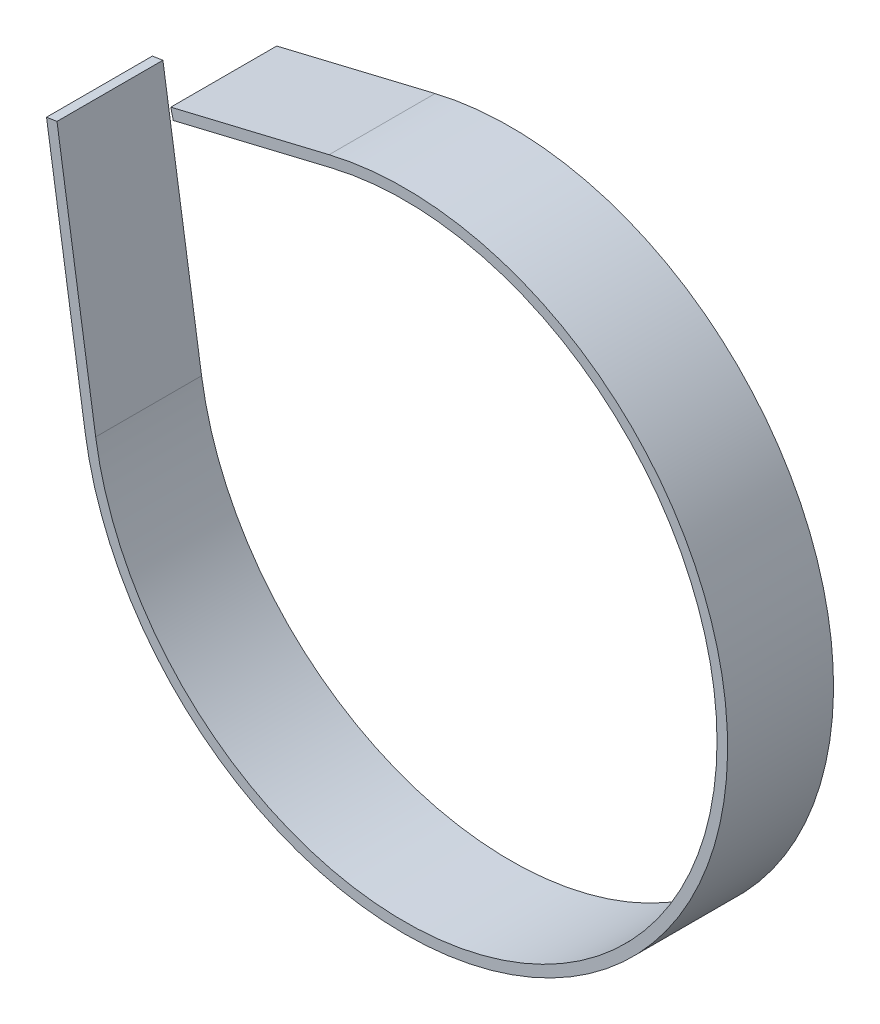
ISO-10303-21;
HEADER;
FILE_DESCRIPTION(('STEP AP214'),'2;1');
FILE_NAME('part.step','',(''),(''),'','','');
FILE_SCHEMA(('AUTOMOTIVE_DESIGN { 1 0 10303 214 1 1 1 1 }'));
ENDSEC;
DATA;
#1=APPLICATION_CONTEXT('core data for automotive mechanical design processes');
#2=APPLICATION_PROTOCOL_DEFINITION('international standard','automotive_design',2000,#1);
#3=PRODUCT_CONTEXT('',#1,'mechanical');
#4=PRODUCT('Part','Part','',(#3));
#5=PRODUCT_RELATED_PRODUCT_CATEGORY('part','',(#4));
#6=PRODUCT_DEFINITION_FORMATION('','',#4);
#7=PRODUCT_DEFINITION_CONTEXT('part definition',#1,'design');
#8=PRODUCT_DEFINITION('design','',#6,#7);
#9=PRODUCT_DEFINITION_SHAPE('','',#8);
#10=(LENGTH_UNIT() NAMED_UNIT(*) SI_UNIT(.MILLI.,.METRE.));
#11=(NAMED_UNIT(*) PLANE_ANGLE_UNIT() SI_UNIT($,.RADIAN.));
#12=(NAMED_UNIT(*) SI_UNIT($,.STERADIAN.) SOLID_ANGLE_UNIT());
#13=UNCERTAINTY_MEASURE_WITH_UNIT(LENGTH_MEASURE(1.E-05),#10,'distance_accuracy_value','');
#14=(GEOMETRIC_REPRESENTATION_CONTEXT(3) GLOBAL_UNCERTAINTY_ASSIGNED_CONTEXT((#13)) GLOBAL_UNIT_ASSIGNED_CONTEXT((#10,
#11,#12)) REPRESENTATION_CONTEXT('',''));
#15=CARTESIAN_POINT('',(0.,0.,0.));
#16=DIRECTION('',(0.,0.,1.));
#17=DIRECTION('',(1.,0.,0.));
#18=AXIS2_PLACEMENT_3D('',#15,#16,#17);
#19=CARTESIAN_POINT('',(0.,0.,80.));
#20=DIRECTION('',(0.,0.,-1.));
#21=DIRECTION('',(-1.,0.,0.));
#22=AXIS2_PLACEMENT_3D('',#19,#20,#21);
#23=CYLINDRICAL_SURFACE('',#22,236.);
#24=CARTESIAN_POINT('',(0.,0.,0.));
#25=DIRECTION('',(0.,0.,-1.));
#26=DIRECTION('',(1.,0.,0.));
#27=AXIS2_PLACEMENT_3D('',#24,#25,#26);
#28=CIRCLE('',#27,236.);
#29=CARTESIAN_POINT('',(-55.0931058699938,229.479301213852,0.));
#30=VERTEX_POINT('',#29);
#31=CARTESIAN_POINT('',(-233.309422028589,-35.5346815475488,0.));
#32=VERTEX_POINT('',#31);
#33=EDGE_CURVE('E98',#30,#32,#28,.T.);
#34=ORIENTED_EDGE('',*,*,#33,.T.);
#35=DIRECTION('',(0.,0.,-1.));
#36=VECTOR('',#35,1.);
#37=CARTESIAN_POINT('',(-233.309422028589,-35.5346815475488,80.));
#38=LINE('',#37,#36);
#39=CARTESIAN_POINT('',(-233.309422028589,-35.5346815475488,80.));
#40=VERTEX_POINT('',#39);
#41=EDGE_CURVE('E11',#40,#32,#38,.T.);
#42=ORIENTED_EDGE('',*,*,#41,.F.);
#43=CARTESIAN_POINT('',(0.,0.,80.));
#44=DIRECTION('',(0.,0.,-1.));
#45=DIRECTION('',(1.,0.,0.));
#46=AXIS2_PLACEMENT_3D('',#43,#44,#45);
#47=CIRCLE('',#46,236.);
#48=CARTESIAN_POINT('',(-55.0931058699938,229.479301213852,80.));
#49=VERTEX_POINT('',#48);
#50=EDGE_CURVE('E125',#49,#40,#47,.T.);
#51=ORIENTED_EDGE('',*,*,#50,.F.);
#52=DIRECTION('',(0.,0.,-1.));
#53=VECTOR('',#52,1.);
#54=CARTESIAN_POINT('',(-55.0931058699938,229.479301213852,80.));
#55=LINE('',#54,#53);
#56=EDGE_CURVE('E111',#49,#30,#55,.T.);
#57=ORIENTED_EDGE('',*,*,#56,.T.);
#58=EDGE_LOOP('',(#34,#42,#51,#57));
#59=FACE_BOUND('',#58,.T.);
#60=ADVANCED_FACE('F30',(#59),#23,.F.);
#61=CARTESIAN_POINT('',(-233.309422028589,-35.5346815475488,80.));
#62=DIRECTION('',(-0.988599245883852,-0.150570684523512,0.));
#63=DIRECTION('',(0.150570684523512,-0.988599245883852,0.));
#64=AXIS2_PLACEMENT_3D('',#61,#62,#63);
#65=PLANE('',#64);
#66=DIRECTION('',(-0.150570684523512,0.988599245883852,0.));
#67=VECTOR('',#66,1.);
#68=CARTESIAN_POINT('',(-233.309422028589,-35.5346815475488,0.));
#69=LINE('',#68,#67);
#70=CARTESIAN_POINT('',(-262.52013482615,156.253572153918,0.));
#71=VERTEX_POINT('',#70);
#72=EDGE_CURVE('E94',#32,#71,#69,.T.);
#73=ORIENTED_EDGE('',*,*,#72,.T.);
#74=DIRECTION('',(0.,0.,-1.));
#75=VECTOR('',#74,1.);
#76=CARTESIAN_POINT('',(-262.52013482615,156.253572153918,80.));
#77=LINE('',#76,#75);
#78=CARTESIAN_POINT('',(-262.52013482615,156.253572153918,80.));
#79=VERTEX_POINT('',#78);
#80=EDGE_CURVE('E37',#79,#71,#77,.T.);
#81=ORIENTED_EDGE('',*,*,#80,.F.);
#82=DIRECTION('',(-0.150570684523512,0.988599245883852,0.));
#83=VECTOR('',#82,1.);
#84=CARTESIAN_POINT('',(-233.309422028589,-35.5346815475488,80.));
#85=LINE('',#84,#83);
#86=EDGE_CURVE('E107',#40,#79,#85,.T.);
#87=ORIENTED_EDGE('',*,*,#86,.F.);
#88=ORIENTED_EDGE('',*,*,#41,.T.);
#89=EDGE_LOOP('',(#73,#81,#87,#88));
#90=FACE_BOUND('',#89,.T.);
#91=ADVANCED_FACE('F106',(#90),#65,.F.);
#92=CARTESIAN_POINT('',(-270.428928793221,155.04900667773,80.));
#93=DIRECTION('',(0.150570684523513,-0.988599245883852,0.));
#94=DIRECTION('',(0.988599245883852,0.150570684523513,0.));
#95=AXIS2_PLACEMENT_3D('',#92,#93,#94);
#96=PLANE('',#95);
#97=DIRECTION('',(-0.988599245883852,-0.150570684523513,0.));
#98=VECTOR('',#97,1.);
#99=CARTESIAN_POINT('',(-270.428928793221,155.04900667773,0.));
#100=LINE('',#99,#98);
#101=CARTESIAN_POINT('',(-270.428928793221,155.04900667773,0.));
#102=VERTEX_POINT('',#101);
#103=EDGE_CURVE('E100',#71,#102,#100,.T.);
#104=ORIENTED_EDGE('',*,*,#103,.T.);
#105=DIRECTION('',(0.,0.,-1.));
#106=VECTOR('',#105,1.);
#107=CARTESIAN_POINT('',(-270.428928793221,155.04900667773,80.));
#108=LINE('',#107,#106);
#109=CARTESIAN_POINT('',(-270.428928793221,155.04900667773,80.));
#110=VERTEX_POINT('',#109);
#111=EDGE_CURVE('E151',#110,#102,#108,.T.);
#112=ORIENTED_EDGE('',*,*,#111,.F.);
#113=DIRECTION('',(-0.988599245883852,-0.150570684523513,0.));
#114=VECTOR('',#113,1.);
#115=CARTESIAN_POINT('',(-270.428928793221,155.04900667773,80.));
#116=LINE('',#115,#114);
#117=EDGE_CURVE('E128',#79,#110,#116,.T.);
#118=ORIENTED_EDGE('',*,*,#117,.F.);
#119=ORIENTED_EDGE('',*,*,#80,.T.);
#120=EDGE_LOOP('',(#104,#112,#118,#119));
#121=FACE_BOUND('',#120,.T.);
#122=ADVANCED_FACE('F155',(#121),#96,.F.);
#123=CARTESIAN_POINT('',(-241.21821599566,-36.739247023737,80.));
#124=DIRECTION('',(0.988599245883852,0.150570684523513,0.));
#125=DIRECTION('',(-0.150570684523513,0.988599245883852,0.));
#126=AXIS2_PLACEMENT_3D('',#123,#124,#125);
#127=PLANE('',#126);
#128=DIRECTION('',(0.150570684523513,-0.988599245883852,0.));
#129=VECTOR('',#128,1.);
#130=CARTESIAN_POINT('',(-241.21821599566,-36.739247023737,0.));
#131=LINE('',#130,#129);
#132=CARTESIAN_POINT('',(-241.21821599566,-36.739247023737,0.));
#133=VERTEX_POINT('',#132);
#134=EDGE_CURVE('E115',#102,#133,#131,.T.);
#135=ORIENTED_EDGE('',*,*,#134,.T.);
#136=DIRECTION('',(0.,0.,-1.));
#137=VECTOR('',#136,1.);
#138=CARTESIAN_POINT('',(-241.21821599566,-36.739247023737,80.));
#139=LINE('',#138,#137);
#140=CARTESIAN_POINT('',(-241.21821599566,-36.739247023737,80.));
#141=VERTEX_POINT('',#140);
#142=EDGE_CURVE('E148',#141,#133,#139,.T.);
#143=ORIENTED_EDGE('',*,*,#142,.F.);
#144=DIRECTION('',(0.150570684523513,-0.988599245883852,0.));
#145=VECTOR('',#144,1.);
#146=CARTESIAN_POINT('',(-241.21821599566,-36.739247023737,80.));
#147=LINE('',#146,#145);
#148=EDGE_CURVE('E130',#110,#141,#147,.T.);
#149=ORIENTED_EDGE('',*,*,#148,.F.);
#150=ORIENTED_EDGE('',*,*,#111,.T.);
#151=EDGE_LOOP('',(#135,#143,#149,#150));
#152=FACE_BOUND('',#151,.T.);
#153=ADVANCED_FACE('F163',(#152),#127,.F.);
#154=CARTESIAN_POINT('',(0.,0.,80.));
#155=DIRECTION('',(0.,0.,-1.));
#156=DIRECTION('',(-1.,0.,0.));
#157=AXIS2_PLACEMENT_3D('',#154,#155,#156);
#158=CYLINDRICAL_SURFACE('',#157,244.);
#159=CARTESIAN_POINT('',(0.,0.,0.));
#160=DIRECTION('',(0.,0.,1.));
#161=DIRECTION('',(1.,0.,0.));
#162=AXIS2_PLACEMENT_3D('',#159,#160,#161);
#163=CIRCLE('',#162,244.);
#164=CARTESIAN_POINT('',(-56.9606687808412,237.258260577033,0.));
#165=VERTEX_POINT('',#164);
#166=EDGE_CURVE('E117',#133,#165,#163,.T.);
#167=ORIENTED_EDGE('',*,*,#166,.T.);
#168=DIRECTION('',(0.,0.,-1.));
#169=VECTOR('',#168,1.);
#170=CARTESIAN_POINT('',(-56.9606687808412,237.258260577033,80.));
#171=LINE('',#170,#169);
#172=CARTESIAN_POINT('',(-56.9606687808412,237.258260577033,80.));
#173=VERTEX_POINT('',#172);
#174=EDGE_CURVE('E145',#173,#165,#171,.T.);
#175=ORIENTED_EDGE('',*,*,#174,.F.);
#176=CARTESIAN_POINT('',(0.,0.,80.));
#177=DIRECTION('',(0.,0.,1.));
#178=DIRECTION('',(1.,0.,0.));
#179=AXIS2_PLACEMENT_3D('',#176,#177,#178);
#180=CIRCLE('',#179,244.);
#181=EDGE_CURVE('E132',#141,#173,#180,.T.);
#182=ORIENTED_EDGE('',*,*,#181,.F.);
#183=ORIENTED_EDGE('',*,*,#142,.T.);
#184=EDGE_LOOP('',(#167,#175,#182,#183));
#185=FACE_BOUND('',#184,.T.);
#186=ADVANCED_FACE('F166',(#185),#158,.T.);
#187=CARTESIAN_POINT('',(-56.9606687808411,237.258260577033,80.));
#188=DIRECTION('',(0.233445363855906,-0.972369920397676,0.));
#189=DIRECTION('',(0.972369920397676,0.233445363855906,0.));
#190=AXIS2_PLACEMENT_3D('',#187,#188,#189);
#191=PLANE('',#190);
#192=DIRECTION('',(-0.972369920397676,-0.233445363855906,0.));
#193=VECTOR('',#192,1.);
#194=CARTESIAN_POINT('',(-56.9606687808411,237.258260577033,0.));
#195=LINE('',#194,#193);
#196=CARTESIAN_POINT('',(-176.562168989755,208.544480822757,0.));
#197=VERTEX_POINT('',#196);
#198=EDGE_CURVE('E119',#165,#197,#195,.T.);
#199=ORIENTED_EDGE('',*,*,#198,.T.);
#200=DIRECTION('',(0.,0.,-1.));
#201=VECTOR('',#200,1.);
#202=CARTESIAN_POINT('',(-176.562168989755,208.544480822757,80.));
#203=LINE('',#202,#201);
#204=CARTESIAN_POINT('',(-176.562168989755,208.544480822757,80.));
#205=VERTEX_POINT('',#204);
#206=EDGE_CURVE('E142',#205,#197,#203,.T.);
#207=ORIENTED_EDGE('',*,*,#206,.F.);
#208=DIRECTION('',(-0.972369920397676,-0.233445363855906,0.));
#209=VECTOR('',#208,1.);
#210=CARTESIAN_POINT('',(-56.9606687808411,237.258260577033,80.));
#211=LINE('',#210,#209);
#212=EDGE_CURVE('E134',#173,#205,#211,.T.);
#213=ORIENTED_EDGE('',*,*,#212,.F.);
#214=ORIENTED_EDGE('',*,*,#174,.T.);
#215=EDGE_LOOP('',(#199,#207,#213,#214));
#216=FACE_BOUND('',#215,.T.);
#217=ADVANCED_FACE('F171',(#216),#191,.F.);
#218=CARTESIAN_POINT('',(-176.562168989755,208.544480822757,80.));
#219=DIRECTION('',(0.972369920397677,0.233445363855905,0.));
#220=DIRECTION('',(-0.233445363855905,0.972369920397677,0.));
#221=AXIS2_PLACEMENT_3D('',#218,#219,#220);
#222=PLANE('',#221);
#223=DIRECTION('',(0.233445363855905,-0.972369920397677,0.));
#224=VECTOR('',#223,1.);
#225=CARTESIAN_POINT('',(-176.562168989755,208.544480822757,0.));
#226=LINE('',#225,#224);
#227=CARTESIAN_POINT('',(-174.694606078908,200.765521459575,0.));
#228=VERTEX_POINT('',#227);
#229=EDGE_CURVE('E121',#197,#228,#226,.T.);
#230=ORIENTED_EDGE('',*,*,#229,.T.);
#231=DIRECTION('',(0.,0.,-1.));
#232=VECTOR('',#231,1.);
#233=CARTESIAN_POINT('',(-174.694606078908,200.765521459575,80.));
#234=LINE('',#233,#232);
#235=CARTESIAN_POINT('',(-174.694606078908,200.765521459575,80.));
#236=VERTEX_POINT('',#235);
#237=EDGE_CURVE('E139',#236,#228,#234,.T.);
#238=ORIENTED_EDGE('',*,*,#237,.F.);
#239=DIRECTION('',(0.233445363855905,-0.972369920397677,0.));
#240=VECTOR('',#239,1.);
#241=CARTESIAN_POINT('',(-176.562168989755,208.544480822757,80.));
#242=LINE('',#241,#240);
#243=EDGE_CURVE('E49',#205,#236,#242,.T.);
#244=ORIENTED_EDGE('',*,*,#243,.F.);
#245=ORIENTED_EDGE('',*,*,#206,.T.);
#246=EDGE_LOOP('',(#230,#238,#244,#245));
#247=FACE_BOUND('',#246,.T.);
#248=ADVANCED_FACE('F174',(#247),#222,.F.);
#249=CARTESIAN_POINT('',(-55.0931058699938,229.479301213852,80.));
#250=DIRECTION('',(-0.233445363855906,0.972369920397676,0.));
#251=DIRECTION('',(-0.972369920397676,-0.233445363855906,0.));
#252=AXIS2_PLACEMENT_3D('',#249,#250,#251);
#253=PLANE('',#252);
#254=DIRECTION('',(0.972369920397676,0.233445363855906,0.));
#255=VECTOR('',#254,1.);
#256=CARTESIAN_POINT('',(-55.0931058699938,229.479301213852,0.));
#257=LINE('',#256,#255);
#258=EDGE_CURVE('E123',#228,#30,#257,.T.);
#259=ORIENTED_EDGE('',*,*,#258,.T.);
#260=ORIENTED_EDGE('',*,*,#56,.F.);
#261=DIRECTION('',(0.972369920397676,0.233445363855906,0.));
#262=VECTOR('',#261,1.);
#263=CARTESIAN_POINT('',(-55.0931058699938,229.479301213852,80.));
#264=LINE('',#263,#262);
#265=EDGE_CURVE('E44',#236,#49,#264,.T.);
#266=ORIENTED_EDGE('',*,*,#265,.F.);
#267=ORIENTED_EDGE('',*,*,#237,.T.);
#268=EDGE_LOOP('',(#259,#260,#266,#267));
#269=FACE_BOUND('',#268,.T.);
#270=ADVANCED_FACE('F176',(#269),#253,.F.);
#271=CARTESIAN_POINT('',(0.,0.,80.));
#272=DIRECTION('',(0.,0.,1.));
#273=DIRECTION('',(1.,0.,0.));
#274=AXIS2_PLACEMENT_3D('',#271,#272,#273);
#275=PLANE('',#274);
#276=ORIENTED_EDGE('',*,*,#50,.T.);
#277=ORIENTED_EDGE('',*,*,#86,.T.);
#278=ORIENTED_EDGE('',*,*,#117,.T.);
#279=ORIENTED_EDGE('',*,*,#148,.T.);
#280=ORIENTED_EDGE('',*,*,#181,.T.);
#281=ORIENTED_EDGE('',*,*,#212,.T.);
#282=ORIENTED_EDGE('',*,*,#243,.T.);
#283=ORIENTED_EDGE('',*,*,#265,.T.);
#284=EDGE_LOOP('',(#276,#277,#278,#279,#280,#281,#282,#283));
#285=FACE_BOUND('',#284,.T.);
#286=ADVANCED_FACE('F158',(#285),#275,.T.);
#287=CARTESIAN_POINT('',(0.,0.,0.));
#288=DIRECTION('',(0.,0.,1.));
#289=DIRECTION('',(1.,0.,0.));
#290=AXIS2_PLACEMENT_3D('',#287,#288,#289);
#291=PLANE('',#290);
#292=ORIENTED_EDGE('',*,*,#33,.F.);
#293=ORIENTED_EDGE('',*,*,#258,.F.);
#294=ORIENTED_EDGE('',*,*,#229,.F.);
#295=ORIENTED_EDGE('',*,*,#198,.F.);
#296=ORIENTED_EDGE('',*,*,#166,.F.);
#297=ORIENTED_EDGE('',*,*,#134,.F.);
#298=ORIENTED_EDGE('',*,*,#103,.F.);
#299=ORIENTED_EDGE('',*,*,#72,.F.);
#300=EDGE_LOOP('',(#292,#293,#294,#295,#296,#297,#298,#299));
#301=FACE_BOUND('',#300,.T.);
#302=ADVANCED_FACE('F95',(#301),#291,.F.);
#303=CLOSED_SHELL('',(#60,#91,#122,#153,#186,#217,#248,#270,#286,#302));
#304=MANIFOLD_SOLID_BREP('B2',#303);
#305=ADVANCED_BREP_SHAPE_REPRESENTATION('',(#18,#304),#14);
#306=SHAPE_DEFINITION_REPRESENTATION(#9,#305);
ENDSEC;
END-ISO-10303-21;
